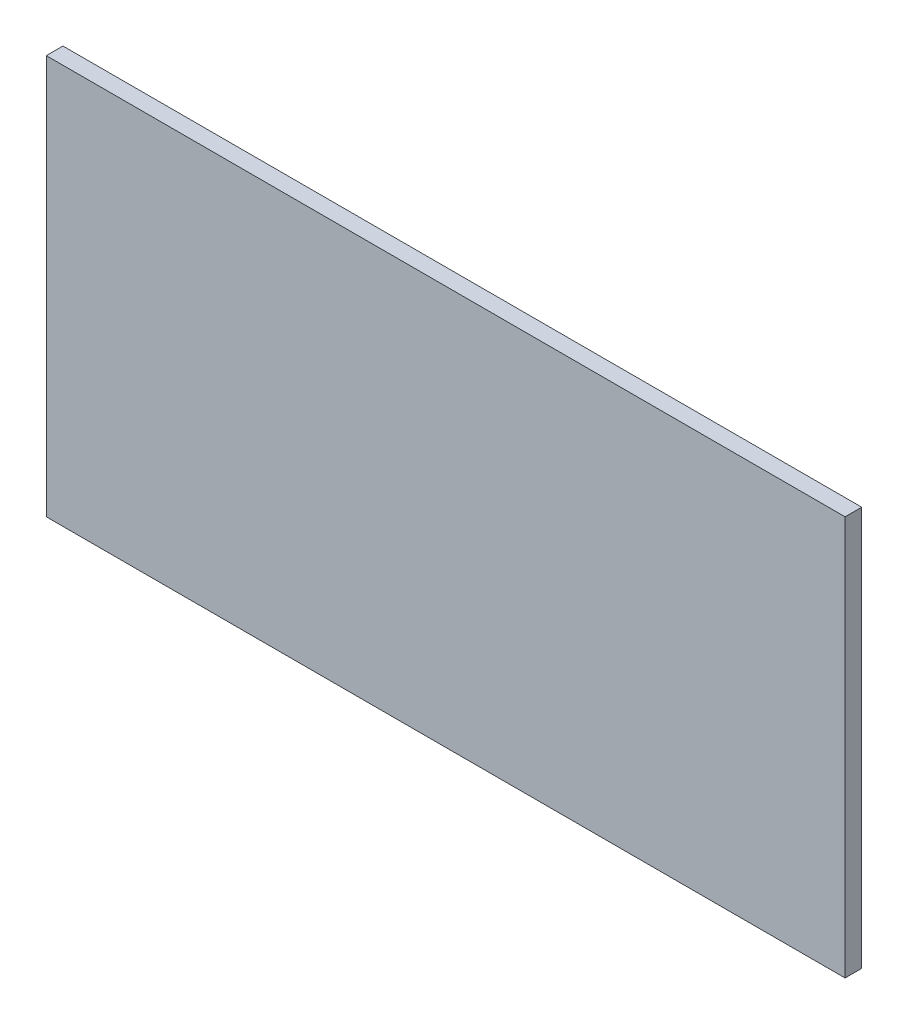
from build123d import *

# Parameters (mm, degrees)
SKETCH1_W      = 609.6
SKETCH1_H      = 304.8
EXTRUDE1_DEPTH = 12.7


with BuildPart() as part:
    # Sketch1 → Extrude1 (new body)
    with BuildSketch(Plane.XY):
        with Locations((304.8, 152.4)):
            Rectangle(SKETCH1_W, SKETCH1_H)
    extrude(amount=EXTRUDE1_DEPTH)


solid = part.part
